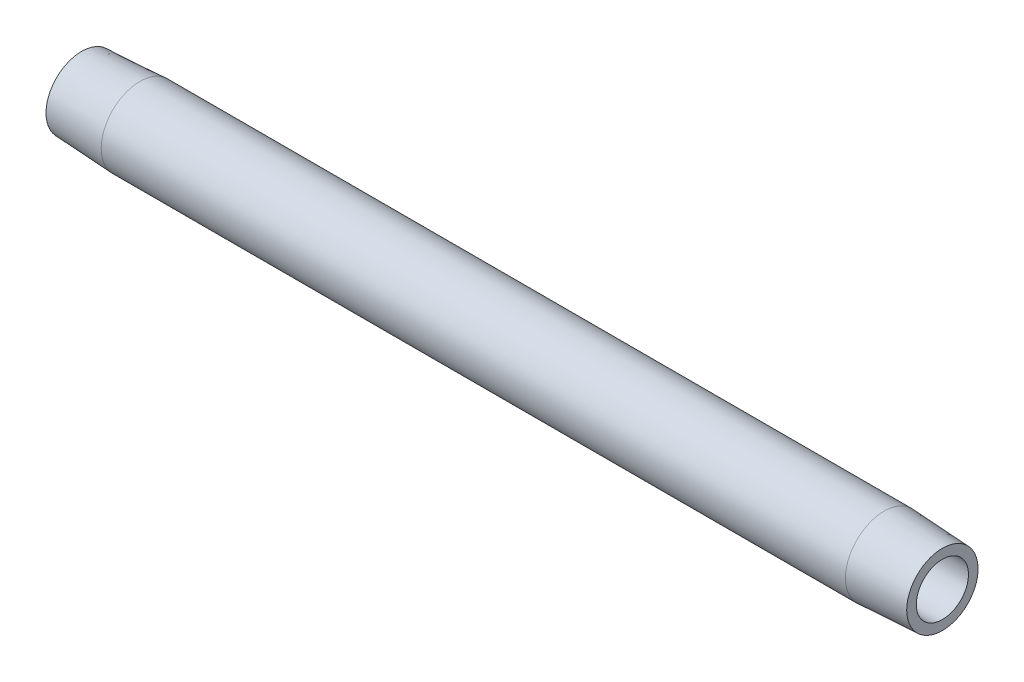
from build123d import *


with BuildPart() as part:
    # Sketch1 → Revolve1 (revolve)
    with BuildSketch(Plane(origin=(0, 0, 0), x_dir=(1, 0, 0), z_dir=(0, 1, 0)), mode=Mode.PRIVATE) as revolve1_sk:
        Polygon((152.4, 4.622776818), (0, 4.622776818), (0, 6.317526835), (10.3124, 6.857976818), (142.0876, 6.857976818), (152.4, 6.317526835), align=None)
    revolve(revolve1_sk.sketch.rotate(Axis((-6.375994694, 0, 0), (1, 0, 0)), 180), axis=Axis((-6.375994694, 0, 0), (1, 0, 0)))


solid = part.part
